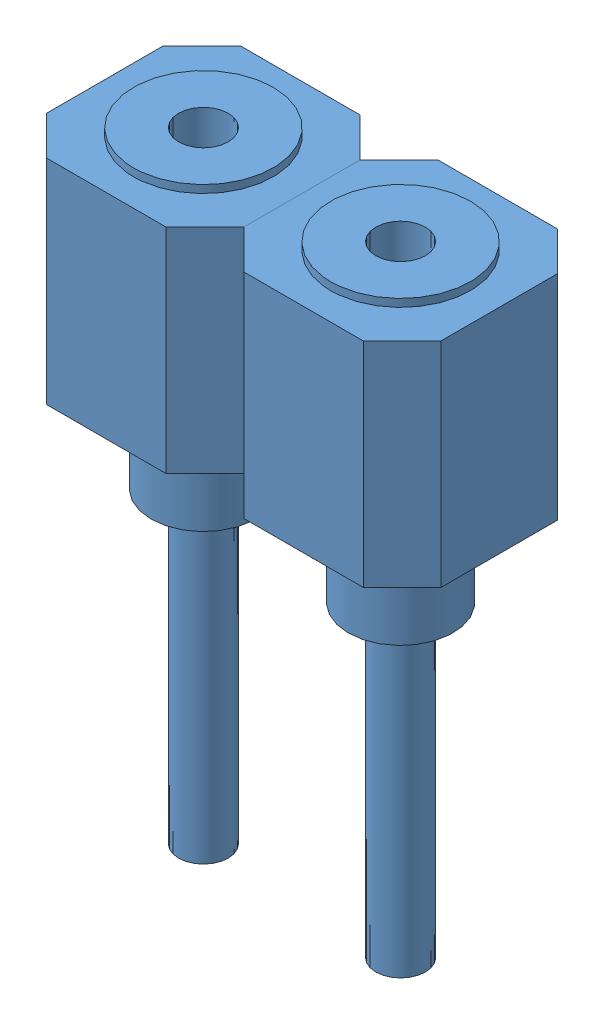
SolidWorks assembly Barette tulipe par 2.SLDPRT.SLDASM, configuration Défaut (file format 8000). Lengths in mm.
Overall size (5.08 7.99 2.5).
2 component instances, 1 part files, 0 mates.
Components (placement in the parent):
- Barette tulipe par 1-1: Barette tulipe par 1.SLDPRT [Défaut] at (-1.1906 0.497 0) size (2.54 7.99 2.5)
- Barette tulipe par 1-2: Barette tulipe par 1.SLDPRT [Défaut] at (1.3494 0.497 0) size (2.54 7.99 2.5)
